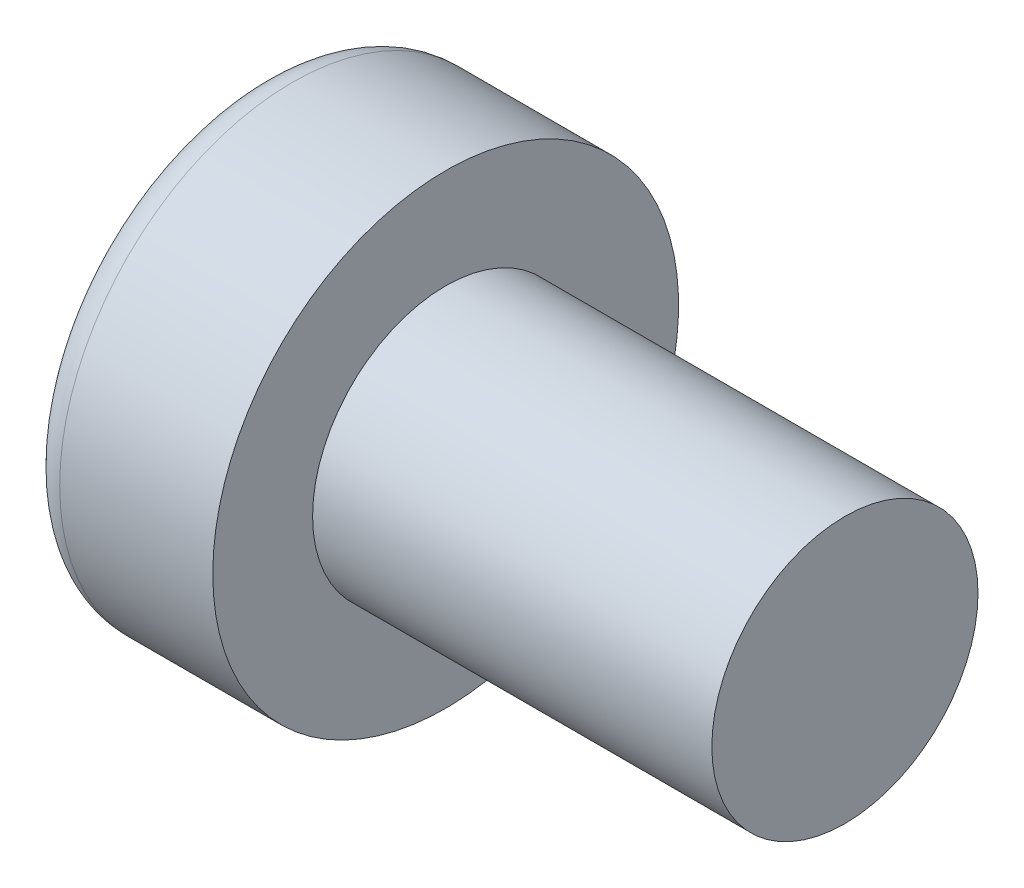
ISO-10303-21;
HEADER;
FILE_DESCRIPTION(('STEP AP214'),'2;1');
FILE_NAME('part.step','',(''),(''),'','','');
FILE_SCHEMA(('AUTOMOTIVE_DESIGN { 1 0 10303 214 1 1 1 1 }'));
ENDSEC;
DATA;
#1=APPLICATION_CONTEXT('core data for automotive mechanical design processes');
#2=APPLICATION_PROTOCOL_DEFINITION('international standard','automotive_design',2000,#1);
#3=PRODUCT_CONTEXT('',#1,'mechanical');
#4=PRODUCT('Part','Part','',(#3));
#5=PRODUCT_RELATED_PRODUCT_CATEGORY('part','',(#4));
#6=PRODUCT_DEFINITION_FORMATION('','',#4);
#7=PRODUCT_DEFINITION_CONTEXT('part definition',#1,'design');
#8=PRODUCT_DEFINITION('design','',#6,#7);
#9=PRODUCT_DEFINITION_SHAPE('','',#8);
#10=(LENGTH_UNIT() NAMED_UNIT(*) SI_UNIT(.MILLI.,.METRE.));
#11=(NAMED_UNIT(*) PLANE_ANGLE_UNIT() SI_UNIT($,.RADIAN.));
#12=(NAMED_UNIT(*) SI_UNIT($,.STERADIAN.) SOLID_ANGLE_UNIT());
#13=UNCERTAINTY_MEASURE_WITH_UNIT(LENGTH_MEASURE(1.E-05),#10,'distance_accuracy_value','');
#14=(GEOMETRIC_REPRESENTATION_CONTEXT(3) GLOBAL_UNCERTAINTY_ASSIGNED_CONTEXT((#13)) GLOBAL_UNIT_ASSIGNED_CONTEXT((#10,
#11,#12)) REPRESENTATION_CONTEXT('',''));
#15=CARTESIAN_POINT('',(0.,0.,0.));
#16=DIRECTION('',(0.,0.,1.));
#17=DIRECTION('',(1.,0.,0.));
#18=AXIS2_PLACEMENT_3D('',#15,#16,#17);
#19=CARTESIAN_POINT('',(-6.,3.5,0.));
#20=DIRECTION('',(-1.,0.,0.));
#21=DIRECTION('',(0.,0.,1.));
#22=AXIS2_PLACEMENT_3D('',#19,#20,#21);
#23=PLANE('',#22);
#24=CARTESIAN_POINT('',(-6.,0.,0.));
#25=DIRECTION('',(-1.,0.,0.));
#26=DIRECTION('',(0.,0.,1.));
#27=AXIS2_PLACEMENT_3D('',#24,#25,#26);
#28=CIRCLE('',#27,3.5);
#29=CARTESIAN_POINT('',(-6.,0.,3.5));
#30=VERTEX_POINT('',#29);
#31=EDGE_CURVE('E148',#30,#30,#28,.T.);
#32=ORIENTED_EDGE('',*,*,#31,.F.);
#33=EDGE_LOOP('',(#32));
#34=FACE_BOUND('',#33,.T.);
#35=CARTESIAN_POINT('',(-6.,0.,0.));
#36=DIRECTION('',(-1.,0.,0.));
#37=DIRECTION('',(0.,0.,1.));
#38=AXIS2_PLACEMENT_3D('',#35,#36,#37);
#39=CIRCLE('',#38,2.);
#40=CARTESIAN_POINT('',(-6.,0.,2.));
#41=VERTEX_POINT('',#40);
#42=EDGE_CURVE('E137',#41,#41,#39,.T.);
#43=ORIENTED_EDGE('',*,*,#42,.T.);
#44=EDGE_LOOP('',(#43));
#45=FACE_BOUND('',#44,.T.);
#46=ADVANCED_FACE('F35',(#34,#45),#23,.F.);
#47=CARTESIAN_POINT('',(-65.0118083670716,0.,0.));
#48=DIRECTION('',(-1.,0.,0.));
#49=DIRECTION('',(0.,0.,1.));
#50=AXIS2_PLACEMENT_3D('',#47,#48,#49);
#51=CYLINDRICAL_SURFACE('',#50,3.5);
#52=CARTESIAN_POINT('',(-8.3,0.,0.));
#53=DIRECTION('',(1.,0.,0.));
#54=DIRECTION('',(0.,0.,-1.));
#55=AXIS2_PLACEMENT_3D('',#52,#53,#54);
#56=CIRCLE('',#55,3.5);
#57=CARTESIAN_POINT('',(-8.3,0.,-3.5));
#58=VERTEX_POINT('',#57);
#59=EDGE_CURVE('E11',#58,#58,#56,.T.);
#60=ORIENTED_EDGE('',*,*,#59,.T.);
#61=EDGE_LOOP('',(#60));
#62=FACE_BOUND('',#61,.T.);
#63=ORIENTED_EDGE('',*,*,#31,.T.);
#64=EDGE_LOOP('',(#63));
#65=FACE_BOUND('',#64,.T.);
#66=ADVANCED_FACE('F170',(#62,#65),#51,.T.);
#67=CARTESIAN_POINT('',(-8.8,0.,0.));
#68=DIRECTION('',(1.,0.,0.));
#69=DIRECTION('',(0.,0.,-1.));
#70=AXIS2_PLACEMENT_3D('',#67,#68,#69);
#71=PLANE('',#70);
#72=DIRECTION('',(0.,0.5,-0.866025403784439));
#73=VECTOR('',#72,1.);
#74=CARTESIAN_POINT('',(-8.8,0.866025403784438,1.5));
#75=LINE('',#74,#73);
#76=CARTESIAN_POINT('',(-8.8,0.866025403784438,1.5));
#77=VERTEX_POINT('',#76);
#78=CARTESIAN_POINT('',(-8.8,1.73205080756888,0.));
#79=VERTEX_POINT('',#78);
#80=EDGE_CURVE('E124',#77,#79,#75,.T.);
#81=ORIENTED_EDGE('',*,*,#80,.F.);
#82=DIRECTION('',(0.,1.,0.));
#83=VECTOR('',#82,1.);
#84=CARTESIAN_POINT('',(-8.8,-0.86602540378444,1.5));
#85=LINE('',#84,#83);
#86=CARTESIAN_POINT('',(-8.8,-0.86602540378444,1.5));
#87=VERTEX_POINT('',#86);
#88=EDGE_CURVE('E50',#87,#77,#85,.T.);
#89=ORIENTED_EDGE('',*,*,#88,.F.);
#90=DIRECTION('',(0.,0.5,0.866025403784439));
#91=VECTOR('',#90,1.);
#92=CARTESIAN_POINT('',(-8.8,-1.73205080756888,0.));
#93=LINE('',#92,#91);
#94=CARTESIAN_POINT('',(-8.8,-1.73205080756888,0.));
#95=VERTEX_POINT('',#94);
#96=EDGE_CURVE('E133',#95,#87,#93,.T.);
#97=ORIENTED_EDGE('',*,*,#96,.F.);
#98=DIRECTION('',(0.,-0.5,0.866025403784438));
#99=VECTOR('',#98,1.);
#100=CARTESIAN_POINT('',(-8.8,-0.866025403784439,-1.5));
#101=LINE('',#100,#99);
#102=CARTESIAN_POINT('',(-8.8,-0.866025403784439,-1.5));
#103=VERTEX_POINT('',#102);
#104=EDGE_CURVE('E131',#103,#95,#101,.T.);
#105=ORIENTED_EDGE('',*,*,#104,.F.);
#106=DIRECTION('',(0.,-1.,0.));
#107=VECTOR('',#106,1.);
#108=CARTESIAN_POINT('',(-8.8,0.866025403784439,-1.5));
#109=LINE('',#108,#107);
#110=CARTESIAN_POINT('',(-8.8,0.866025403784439,-1.5));
#111=VERTEX_POINT('',#110);
#112=EDGE_CURVE('E98',#111,#103,#109,.T.);
#113=ORIENTED_EDGE('',*,*,#112,.F.);
#114=DIRECTION('',(0.,-0.5,-0.866025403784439));
#115=VECTOR('',#114,1.);
#116=CARTESIAN_POINT('',(-8.8,1.73205080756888,0.));
#117=LINE('',#116,#115);
#118=EDGE_CURVE('E127',#79,#111,#117,.T.);
#119=ORIENTED_EDGE('',*,*,#118,.F.);
#120=EDGE_LOOP('',(#81,#89,#97,#105,#113,#119));
#121=FACE_BOUND('',#120,.T.);
#122=CARTESIAN_POINT('',(-8.8,0.,0.));
#123=DIRECTION('',(1.,0.,0.));
#124=DIRECTION('',(0.,0.,-1.));
#125=AXIS2_PLACEMENT_3D('',#122,#123,#124);
#126=CIRCLE('',#125,3.);
#127=CARTESIAN_POINT('',(-8.8,0.,-3.));
#128=VERTEX_POINT('',#127);
#129=EDGE_CURVE('E43',#128,#128,#126,.F.);
#130=ORIENTED_EDGE('',*,*,#129,.T.);
#131=EDGE_LOOP('',(#130));
#132=FACE_BOUND('',#131,.T.);
#133=ADVANCED_FACE('F153',(#121,#132),#71,.F.);
#134=CARTESIAN_POINT('',(0.,2.,0.));
#135=DIRECTION('',(-1.,0.,0.));
#136=DIRECTION('',(0.,0.,1.));
#137=AXIS2_PLACEMENT_3D('',#134,#135,#136);
#138=PLANE('',#137);
#139=CARTESIAN_POINT('',(0.,0.,0.));
#140=DIRECTION('',(-1.,0.,0.));
#141=DIRECTION('',(0.,0.,1.));
#142=AXIS2_PLACEMENT_3D('',#139,#140,#141);
#143=CIRCLE('',#142,2.);
#144=CARTESIAN_POINT('',(0.,0.,2.));
#145=VERTEX_POINT('',#144);
#146=EDGE_CURVE('E145',#145,#145,#143,.T.);
#147=ORIENTED_EDGE('',*,*,#146,.F.);
#148=EDGE_LOOP('',(#147));
#149=FACE_BOUND('',#148,.T.);
#150=ADVANCED_FACE('F165',(#149),#138,.F.);
#151=CARTESIAN_POINT('',(-65.0118083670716,0.,0.));
#152=DIRECTION('',(-1.,0.,0.));
#153=DIRECTION('',(0.,0.,1.));
#154=AXIS2_PLACEMENT_3D('',#151,#152,#153);
#155=CYLINDRICAL_SURFACE('',#154,2.);
#156=ORIENTED_EDGE('',*,*,#42,.F.);
#157=EDGE_LOOP('',(#156));
#158=FACE_BOUND('',#157,.T.);
#159=ORIENTED_EDGE('',*,*,#146,.T.);
#160=EDGE_LOOP('',(#159));
#161=FACE_BOUND('',#160,.T.);
#162=ADVANCED_FACE('F157',(#158,#161),#155,.T.);
#163=CARTESIAN_POINT('',(-8.3,0.,0.));
#164=DIRECTION('',(1.,0.,0.));
#165=DIRECTION('',(0.,0.,-1.));
#166=AXIS2_PLACEMENT_3D('',#163,#164,#165);
#167=TOROIDAL_SURFACE('',#166,3.,0.5);
#168=ORIENTED_EDGE('',*,*,#59,.F.);
#169=EDGE_LOOP('',(#168));
#170=FACE_BOUND('',#169,.T.);
#171=ORIENTED_EDGE('',*,*,#129,.F.);
#172=EDGE_LOOP('',(#171));
#173=FACE_BOUND('',#172,.T.);
#174=ADVANCED_FACE('F37',(#170,#173),#167,.T.);
#175=CARTESIAN_POINT('',(-5.8,-0.86602540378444,1.5));
#176=DIRECTION('',(0.,0.,1.));
#177=DIRECTION('',(0.,-1.,0.));
#178=AXIS2_PLACEMENT_3D('',#175,#176,#177);
#179=PLANE('',#178);
#180=ORIENTED_EDGE('',*,*,#88,.T.);
#181=DIRECTION('',(-1.,0.,0.));
#182=VECTOR('',#181,1.);
#183=CARTESIAN_POINT('',(-5.8,0.866025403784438,1.5));
#184=LINE('',#183,#182);
#185=CARTESIAN_POINT('',(-5.8,0.866025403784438,1.5));
#186=VERTEX_POINT('',#185);
#187=EDGE_CURVE('E80',#186,#77,#184,.T.);
#188=ORIENTED_EDGE('',*,*,#187,.F.);
#189=DIRECTION('',(0.,1.,0.));
#190=VECTOR('',#189,1.);
#191=CARTESIAN_POINT('',(-5.8,-0.86602540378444,1.5));
#192=LINE('',#191,#190);
#193=CARTESIAN_POINT('',(-5.8,-0.86602540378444,1.5));
#194=VERTEX_POINT('',#193);
#195=EDGE_CURVE('E135',#194,#186,#192,.T.);
#196=ORIENTED_EDGE('',*,*,#195,.F.);
#197=DIRECTION('',(-1.,0.,0.));
#198=VECTOR('',#197,1.);
#199=CARTESIAN_POINT('',(-5.8,-0.86602540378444,1.5));
#200=LINE('',#199,#198);
#201=EDGE_CURVE('E58',#194,#87,#200,.T.);
#202=ORIENTED_EDGE('',*,*,#201,.T.);
#203=EDGE_LOOP('',(#180,#188,#196,#202));
#204=FACE_BOUND('',#203,.T.);
#205=ADVANCED_FACE('F156',(#204),#179,.F.);
#206=CARTESIAN_POINT('',(-5.8,-1.73205080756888,0.));
#207=DIRECTION('',(0.,-0.866025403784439,0.5));
#208=DIRECTION('',(0.,-0.5,-0.866025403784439));
#209=AXIS2_PLACEMENT_3D('',#206,#207,#208);
#210=PLANE('',#209);
#211=ORIENTED_EDGE('',*,*,#96,.T.);
#212=ORIENTED_EDGE('',*,*,#201,.F.);
#213=DIRECTION('',(0.,0.5,0.866025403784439));
#214=VECTOR('',#213,1.);
#215=CARTESIAN_POINT('',(-5.8,-1.73205080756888,0.));
#216=LINE('',#215,#214);
#217=CARTESIAN_POINT('',(-5.8,-1.73205080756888,0.));
#218=VERTEX_POINT('',#217);
#219=EDGE_CURVE('E110',#218,#194,#216,.T.);
#220=ORIENTED_EDGE('',*,*,#219,.F.);
#221=DIRECTION('',(-1.,0.,0.));
#222=VECTOR('',#221,1.);
#223=CARTESIAN_POINT('',(-5.8,-1.73205080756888,0.));
#224=LINE('',#223,#222);
#225=EDGE_CURVE('E102',#218,#95,#224,.T.);
#226=ORIENTED_EDGE('',*,*,#225,.T.);
#227=EDGE_LOOP('',(#211,#212,#220,#226));
#228=FACE_BOUND('',#227,.T.);
#229=ADVANCED_FACE('F163',(#228),#210,.F.);
#230=CARTESIAN_POINT('',(-5.8,-0.866025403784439,-1.5));
#231=DIRECTION('',(0.,-0.866025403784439,-0.5));
#232=DIRECTION('',(0.,0.5,-0.866025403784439));
#233=AXIS2_PLACEMENT_3D('',#230,#231,#232);
#234=PLANE('',#233);
#235=ORIENTED_EDGE('',*,*,#104,.T.);
#236=ORIENTED_EDGE('',*,*,#225,.F.);
#237=DIRECTION('',(0.,-0.5,0.866025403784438));
#238=VECTOR('',#237,1.);
#239=CARTESIAN_POINT('',(-5.8,-0.866025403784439,-1.5));
#240=LINE('',#239,#238);
#241=CARTESIAN_POINT('',(-5.8,-0.866025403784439,-1.5));
#242=VERTEX_POINT('',#241);
#243=EDGE_CURVE('E106',#242,#218,#240,.T.);
#244=ORIENTED_EDGE('',*,*,#243,.F.);
#245=DIRECTION('',(-1.,0.,0.));
#246=VECTOR('',#245,1.);
#247=CARTESIAN_POINT('',(-5.8,-0.866025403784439,-1.5));
#248=LINE('',#247,#246);
#249=EDGE_CURVE('E91',#242,#103,#248,.T.);
#250=ORIENTED_EDGE('',*,*,#249,.T.);
#251=EDGE_LOOP('',(#235,#236,#244,#250));
#252=FACE_BOUND('',#251,.T.);
#253=ADVANCED_FACE('F107',(#252),#234,.F.);
#254=CARTESIAN_POINT('',(-5.8,0.866025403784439,-1.5));
#255=DIRECTION('',(0.,0.,-1.));
#256=DIRECTION('',(-1.,0.,0.));
#257=AXIS2_PLACEMENT_3D('',#254,#255,#256);
#258=PLANE('',#257);
#259=ORIENTED_EDGE('',*,*,#112,.T.);
#260=ORIENTED_EDGE('',*,*,#249,.F.);
#261=DIRECTION('',(0.,-1.,0.));
#262=VECTOR('',#261,1.);
#263=CARTESIAN_POINT('',(-5.8,0.866025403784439,-1.5));
#264=LINE('',#263,#262);
#265=CARTESIAN_POINT('',(-5.8,0.866025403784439,-1.5));
#266=VERTEX_POINT('',#265);
#267=EDGE_CURVE('E95',#266,#242,#264,.T.);
#268=ORIENTED_EDGE('',*,*,#267,.F.);
#269=DIRECTION('',(-1.,0.,0.));
#270=VECTOR('',#269,1.);
#271=CARTESIAN_POINT('',(-5.8,0.866025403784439,-1.5));
#272=LINE('',#271,#270);
#273=EDGE_CURVE('E103',#266,#111,#272,.T.);
#274=ORIENTED_EDGE('',*,*,#273,.T.);
#275=EDGE_LOOP('',(#259,#260,#268,#274));
#276=FACE_BOUND('',#275,.T.);
#277=ADVANCED_FACE('F93',(#276),#258,.F.);
#278=CARTESIAN_POINT('',(-5.8,1.73205080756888,0.));
#279=DIRECTION('',(0.,0.866025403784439,-0.5));
#280=DIRECTION('',(0.,0.5,0.866025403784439));
#281=AXIS2_PLACEMENT_3D('',#278,#279,#280);
#282=PLANE('',#281);
#283=ORIENTED_EDGE('',*,*,#118,.T.);
#284=ORIENTED_EDGE('',*,*,#273,.F.);
#285=DIRECTION('',(0.,-0.5,-0.866025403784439));
#286=VECTOR('',#285,1.);
#287=CARTESIAN_POINT('',(-5.8,1.73205080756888,0.));
#288=LINE('',#287,#286);
#289=CARTESIAN_POINT('',(-5.8,1.73205080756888,0.));
#290=VERTEX_POINT('',#289);
#291=EDGE_CURVE('E116',#290,#266,#288,.T.);
#292=ORIENTED_EDGE('',*,*,#291,.F.);
#293=DIRECTION('',(-1.,0.,0.));
#294=VECTOR('',#293,1.);
#295=CARTESIAN_POINT('',(-5.8,1.73205080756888,0.));
#296=LINE('',#295,#294);
#297=EDGE_CURVE('E140',#290,#79,#296,.T.);
#298=ORIENTED_EDGE('',*,*,#297,.T.);
#299=EDGE_LOOP('',(#283,#284,#292,#298));
#300=FACE_BOUND('',#299,.T.);
#301=ADVANCED_FACE('F189',(#300),#282,.F.);
#302=CARTESIAN_POINT('',(-5.8,0.866025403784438,1.5));
#303=DIRECTION('',(0.,0.866025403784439,0.5));
#304=DIRECTION('',(0.,-0.5,0.866025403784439));
#305=AXIS2_PLACEMENT_3D('',#302,#303,#304);
#306=PLANE('',#305);
#307=ORIENTED_EDGE('',*,*,#80,.T.);
#308=ORIENTED_EDGE('',*,*,#297,.F.);
#309=DIRECTION('',(0.,0.5,-0.866025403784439));
#310=VECTOR('',#309,1.);
#311=CARTESIAN_POINT('',(-5.8,0.866025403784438,1.5));
#312=LINE('',#311,#310);
#313=EDGE_CURVE('E118',#186,#290,#312,.T.);
#314=ORIENTED_EDGE('',*,*,#313,.F.);
#315=ORIENTED_EDGE('',*,*,#187,.T.);
#316=EDGE_LOOP('',(#307,#308,#314,#315));
#317=FACE_BOUND('',#316,.T.);
#318=ADVANCED_FACE('F186',(#317),#306,.F.);
#319=CARTESIAN_POINT('',(-5.8,0.,0.));
#320=DIRECTION('',(-1.,0.,0.));
#321=DIRECTION('',(0.,0.,1.));
#322=AXIS2_PLACEMENT_3D('',#319,#320,#321);
#323=PLANE('',#322);
#324=ORIENTED_EDGE('',*,*,#195,.T.);
#325=ORIENTED_EDGE('',*,*,#313,.T.);
#326=ORIENTED_EDGE('',*,*,#291,.T.);
#327=ORIENTED_EDGE('',*,*,#267,.T.);
#328=ORIENTED_EDGE('',*,*,#243,.T.);
#329=ORIENTED_EDGE('',*,*,#219,.T.);
#330=EDGE_LOOP('',(#324,#325,#326,#327,#328,#329));
#331=FACE_BOUND('',#330,.T.);
#332=ADVANCED_FACE('F113',(#331),#323,.T.);
#333=CLOSED_SHELL('',(#46,#66,#133,#150,#162,#174,#205,#229,#253,#277,#301,#318,#332));
#334=MANIFOLD_SOLID_BREP('B2',#333);
#335=ADVANCED_BREP_SHAPE_REPRESENTATION('',(#18,#334),#14);
#336=SHAPE_DEFINITION_REPRESENTATION(#9,#335);
ENDSEC;
END-ISO-10303-21;
